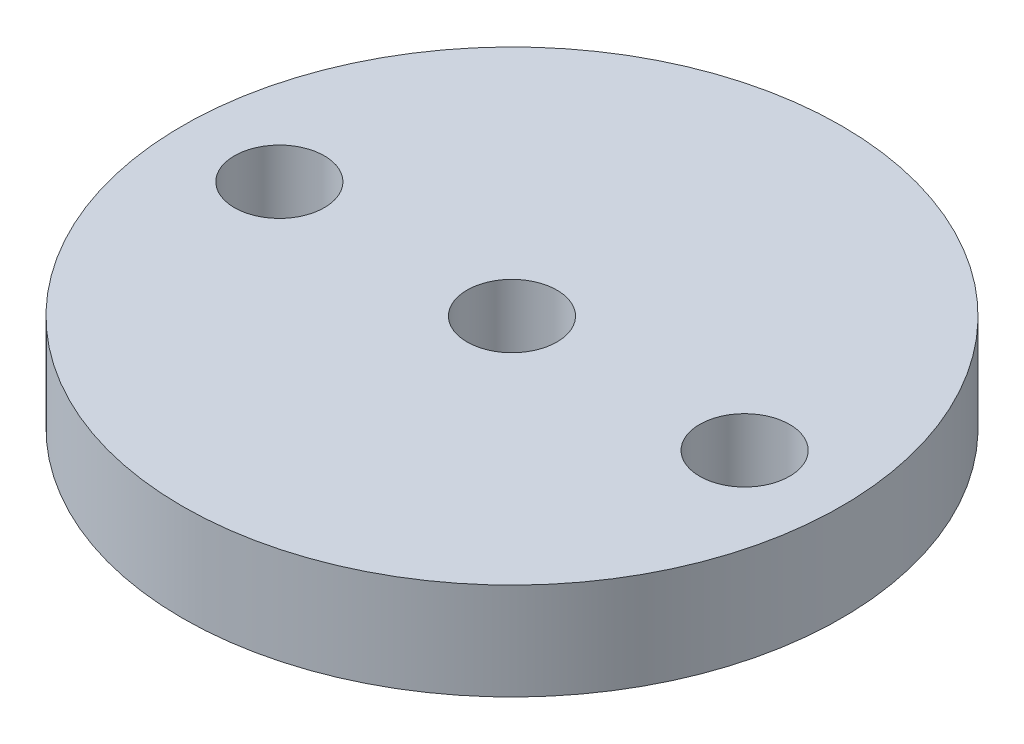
ISO-10303-21;
HEADER;
FILE_DESCRIPTION(('STEP AP214'),'2;1');
FILE_NAME('part.step','',(''),(''),'','','');
FILE_SCHEMA(('AUTOMOTIVE_DESIGN { 1 0 10303 214 1 1 1 1 }'));
ENDSEC;
DATA;
#1=APPLICATION_CONTEXT('core data for automotive mechanical design processes');
#2=APPLICATION_PROTOCOL_DEFINITION('international standard','automotive_design',2000,#1);
#3=PRODUCT_CONTEXT('',#1,'mechanical');
#4=PRODUCT('Part','Part','',(#3));
#5=PRODUCT_RELATED_PRODUCT_CATEGORY('part','',(#4));
#6=PRODUCT_DEFINITION_FORMATION('','',#4);
#7=PRODUCT_DEFINITION_CONTEXT('part definition',#1,'design');
#8=PRODUCT_DEFINITION('design','',#6,#7);
#9=PRODUCT_DEFINITION_SHAPE('','',#8);
#10=(LENGTH_UNIT() NAMED_UNIT(*) SI_UNIT(.MILLI.,.METRE.));
#11=(NAMED_UNIT(*) PLANE_ANGLE_UNIT() SI_UNIT($,.RADIAN.));
#12=(NAMED_UNIT(*) SI_UNIT($,.STERADIAN.) SOLID_ANGLE_UNIT());
#13=UNCERTAINTY_MEASURE_WITH_UNIT(LENGTH_MEASURE(1.E-05),#10,'distance_accuracy_value','');
#14=(GEOMETRIC_REPRESENTATION_CONTEXT(3) GLOBAL_UNCERTAINTY_ASSIGNED_CONTEXT((#13)) GLOBAL_UNIT_ASSIGNED_CONTEXT((#10,
#11,#12)) REPRESENTATION_CONTEXT('',''));
#15=CARTESIAN_POINT('',(0.,0.,0.));
#16=DIRECTION('',(0.,0.,1.));
#17=DIRECTION('',(1.,0.,0.));
#18=AXIS2_PLACEMENT_3D('',#15,#16,#17);
#19=CARTESIAN_POINT('',(0.,3.175,0.));
#20=DIRECTION('',(0.,-1.,0.));
#21=DIRECTION('',(0.,0.,-1.));
#22=AXIS2_PLACEMENT_3D('',#19,#20,#21);
#23=CYLINDRICAL_SURFACE('',#22,10.795);
#24=CARTESIAN_POINT('',(0.,3.175,0.));
#25=DIRECTION('',(0.,1.,0.));
#26=DIRECTION('',(0.,0.,1.));
#27=AXIS2_PLACEMENT_3D('',#24,#25,#26);
#28=CIRCLE('',#27,10.795);
#29=CARTESIAN_POINT('',(0.,3.175,10.795));
#30=VERTEX_POINT('',#29);
#31=EDGE_CURVE('E10',#30,#30,#28,.T.);
#32=ORIENTED_EDGE('',*,*,#31,.F.);
#33=EDGE_LOOP('',(#32));
#34=FACE_BOUND('',#33,.T.);
#35=CARTESIAN_POINT('',(0.,0.,0.));
#36=DIRECTION('',(0.,1.,0.));
#37=DIRECTION('',(0.,0.,1.));
#38=AXIS2_PLACEMENT_3D('',#35,#36,#37);
#39=CIRCLE('',#38,10.795);
#40=CARTESIAN_POINT('',(0.,0.,10.795));
#41=VERTEX_POINT('',#40);
#42=EDGE_CURVE('E33',#41,#41,#39,.T.);
#43=ORIENTED_EDGE('',*,*,#42,.T.);
#44=EDGE_LOOP('',(#43));
#45=FACE_BOUND('',#44,.T.);
#46=ADVANCED_FACE('F30',(#34,#45),#23,.T.);
#47=CARTESIAN_POINT('',(0.,3.175,0.));
#48=DIRECTION('',(0.,1.,0.));
#49=DIRECTION('',(0.,0.,1.));
#50=AXIS2_PLACEMENT_3D('',#47,#48,#49);
#51=PLANE('',#50);
#52=CARTESIAN_POINT('',(-7.62,3.175,0.));
#53=DIRECTION('',(0.,1.,0.));
#54=DIRECTION('',(0.,0.,1.));
#55=AXIS2_PLACEMENT_3D('',#52,#53,#54);
#56=CIRCLE('',#55,1.4732);
#57=CARTESIAN_POINT('',(-7.62,3.175,1.4732));
#58=VERTEX_POINT('',#57);
#59=EDGE_CURVE('E56',#58,#58,#56,.T.);
#60=ORIENTED_EDGE('',*,*,#59,.F.);
#61=EDGE_LOOP('',(#60));
#62=FACE_BOUND('',#61,.T.);
#63=CARTESIAN_POINT('',(7.62,3.175,0.));
#64=DIRECTION('',(0.,1.,0.));
#65=DIRECTION('',(0.,0.,1.));
#66=AXIS2_PLACEMENT_3D('',#63,#64,#65);
#67=CIRCLE('',#66,1.4732);
#68=CARTESIAN_POINT('',(7.62,3.175,1.4732));
#69=VERTEX_POINT('',#68);
#70=EDGE_CURVE('E50',#69,#69,#67,.T.);
#71=ORIENTED_EDGE('',*,*,#70,.F.);
#72=EDGE_LOOP('',(#71));
#73=FACE_BOUND('',#72,.T.);
#74=CARTESIAN_POINT('',(0.,3.175,0.));
#75=DIRECTION('',(0.,1.,0.));
#76=DIRECTION('',(0.,0.,1.));
#77=AXIS2_PLACEMENT_3D('',#74,#75,#76);
#78=CIRCLE('',#77,1.4732);
#79=CARTESIAN_POINT('',(0.,3.175,1.4732));
#80=VERTEX_POINT('',#79);
#81=EDGE_CURVE('E44',#80,#80,#78,.T.);
#82=ORIENTED_EDGE('',*,*,#81,.F.);
#83=EDGE_LOOP('',(#82));
#84=FACE_BOUND('',#83,.T.);
#85=ORIENTED_EDGE('',*,*,#31,.T.);
#86=EDGE_LOOP('',(#85));
#87=FACE_BOUND('',#86,.T.);
#88=ADVANCED_FACE('F62',(#62,#73,#84,#87),#51,.T.);
#89=CARTESIAN_POINT('',(0.,0.,0.));
#90=DIRECTION('',(0.,1.,0.));
#91=DIRECTION('',(0.,0.,1.));
#92=AXIS2_PLACEMENT_3D('',#89,#90,#91);
#93=PLANE('',#92);
#94=CARTESIAN_POINT('',(-7.62,0.,0.));
#95=DIRECTION('',(0.,1.,0.));
#96=DIRECTION('',(0.,0.,1.));
#97=AXIS2_PLACEMENT_3D('',#94,#95,#96);
#98=CIRCLE('',#97,1.4732);
#99=CARTESIAN_POINT('',(-7.62,0.,1.4732));
#100=VERTEX_POINT('',#99);
#101=EDGE_CURVE('E53',#100,#100,#98,.T.);
#102=ORIENTED_EDGE('',*,*,#101,.T.);
#103=EDGE_LOOP('',(#102));
#104=FACE_BOUND('',#103,.T.);
#105=CARTESIAN_POINT('',(7.62,0.,0.));
#106=DIRECTION('',(0.,1.,0.));
#107=DIRECTION('',(0.,0.,1.));
#108=AXIS2_PLACEMENT_3D('',#105,#106,#107);
#109=CIRCLE('',#108,1.4732);
#110=CARTESIAN_POINT('',(7.62,0.,1.4732));
#111=VERTEX_POINT('',#110);
#112=EDGE_CURVE('E47',#111,#111,#109,.T.);
#113=ORIENTED_EDGE('',*,*,#112,.T.);
#114=EDGE_LOOP('',(#113));
#115=FACE_BOUND('',#114,.T.);
#116=CARTESIAN_POINT('',(0.,0.,0.));
#117=DIRECTION('',(0.,1.,0.));
#118=DIRECTION('',(0.,0.,1.));
#119=AXIS2_PLACEMENT_3D('',#116,#117,#118);
#120=CIRCLE('',#119,1.4732);
#121=CARTESIAN_POINT('',(0.,0.,1.4732));
#122=VERTEX_POINT('',#121);
#123=EDGE_CURVE('E40',#122,#122,#120,.T.);
#124=ORIENTED_EDGE('',*,*,#123,.T.);
#125=EDGE_LOOP('',(#124));
#126=FACE_BOUND('',#125,.T.);
#127=ORIENTED_EDGE('',*,*,#42,.F.);
#128=EDGE_LOOP('',(#127));
#129=FACE_BOUND('',#128,.T.);
#130=ADVANCED_FACE('F65',(#104,#115,#126,#129),#93,.F.);
#131=CARTESIAN_POINT('',(0.,3.175,0.));
#132=DIRECTION('',(0.,1.,0.));
#133=DIRECTION('',(0.,0.,1.));
#134=AXIS2_PLACEMENT_3D('',#131,#132,#133);
#135=CYLINDRICAL_SURFACE('',#134,1.4732);
#136=ORIENTED_EDGE('',*,*,#123,.F.);
#137=EDGE_LOOP('',(#136));
#138=FACE_BOUND('',#137,.T.);
#139=ORIENTED_EDGE('',*,*,#81,.T.);
#140=EDGE_LOOP('',(#139));
#141=FACE_BOUND('',#140,.T.);
#142=ADVANCED_FACE('F71',(#138,#141),#135,.F.);
#143=CARTESIAN_POINT('',(7.62,3.175,0.));
#144=DIRECTION('',(0.,1.,0.));
#145=DIRECTION('',(0.,0.,1.));
#146=AXIS2_PLACEMENT_3D('',#143,#144,#145);
#147=CYLINDRICAL_SURFACE('',#146,1.4732);
#148=ORIENTED_EDGE('',*,*,#112,.F.);
#149=EDGE_LOOP('',(#148));
#150=FACE_BOUND('',#149,.T.);
#151=ORIENTED_EDGE('',*,*,#70,.T.);
#152=EDGE_LOOP('',(#151));
#153=FACE_BOUND('',#152,.T.);
#154=ADVANCED_FACE('F73',(#150,#153),#147,.F.);
#155=CARTESIAN_POINT('',(-7.62,3.175,0.));
#156=DIRECTION('',(0.,1.,0.));
#157=DIRECTION('',(0.,0.,1.));
#158=AXIS2_PLACEMENT_3D('',#155,#156,#157);
#159=CYLINDRICAL_SURFACE('',#158,1.4732);
#160=ORIENTED_EDGE('',*,*,#101,.F.);
#161=EDGE_LOOP('',(#160));
#162=FACE_BOUND('',#161,.T.);
#163=ORIENTED_EDGE('',*,*,#59,.T.);
#164=EDGE_LOOP('',(#163));
#165=FACE_BOUND('',#164,.T.);
#166=ADVANCED_FACE('F60',(#162,#165),#159,.F.);
#167=CLOSED_SHELL('',(#46,#88,#130,#142,#154,#166));
#168=MANIFOLD_SOLID_BREP('B2',#167);
#169=ADVANCED_BREP_SHAPE_REPRESENTATION('',(#18,#168),#14);
#170=SHAPE_DEFINITION_REPRESENTATION(#9,#169);
ENDSEC;
END-ISO-10303-21;
